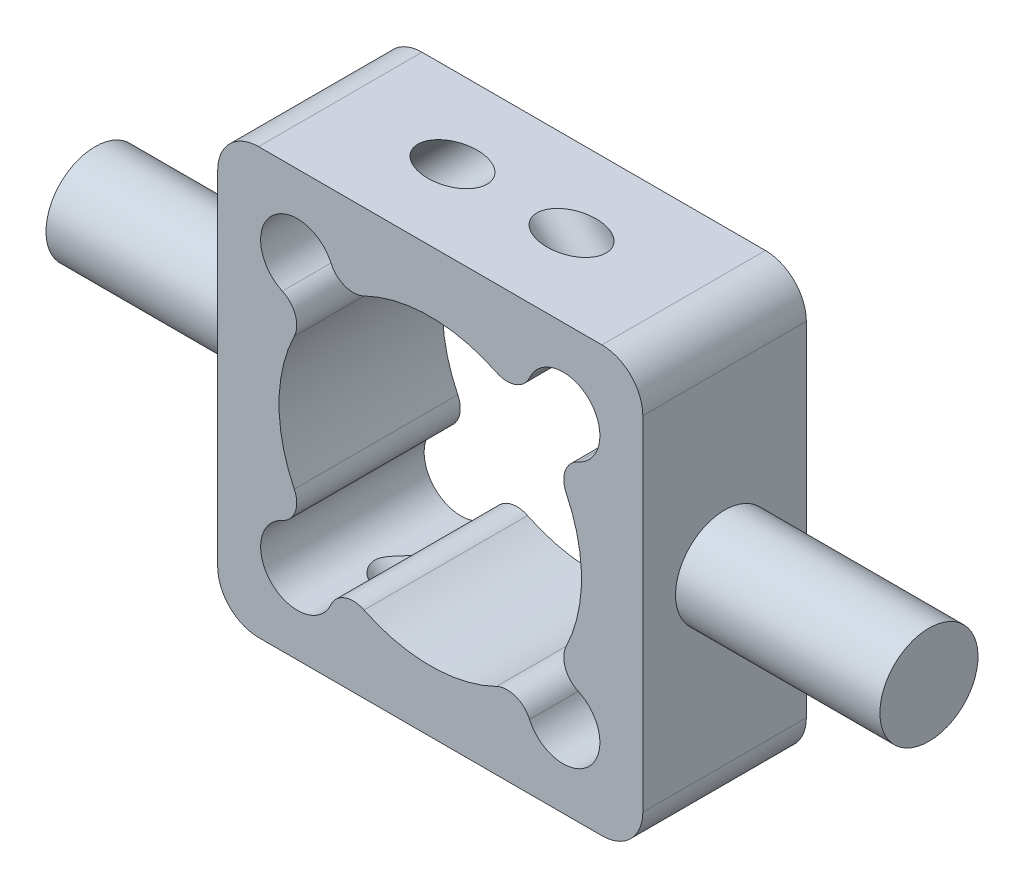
from build123d import *

# Parameters (mm, degrees)
ESBO_O1_W                 = 52
ESBO_O1_H                 = 52
EXTRUS_O1_DEPTH           = 20
ESBO_O2_R                 = 6
EXTRUS_O2_DEPTH           = 25
FILETE2_R                 = 5
ESBO_O6_R                 = 3
EXTRUS_O5_DEPTH           = 25
ESPELHAR3_COPY_1_SKETCH_R = 3
ESPELHAR3_COPY_1_DEPTH    = 25


with BuildPart() as part:
    # Esbo_o1 → Extrus_o1 (new body)
    with BuildSketch(Plane.XY):
        Rectangle(ESBO_O1_W, ESBO_O1_H)
        with BuildLine():
            ThreePointArc((-16.633205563, 8.098547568), (-18.5, 0), (-16.633205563, -8.098547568))
            ThreePointArc((-16.633205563, -8.098547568), (-16.509512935, -10.432674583), (-18.098289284, -12.147095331))
            ThreePointArc((-18.098289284, -12.147095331), (-19.431980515, -19.431980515), (-12.147095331, -18.098289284))
            ThreePointArc((-12.147095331, -18.098289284), (-10.432674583, -16.509512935), (-8.098547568, -16.633205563))
            ThreePointArc((-8.098547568, -16.633205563), (0, -18.5), (8.098547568, -16.633205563))
            ThreePointArc((8.098547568, -16.633205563), (10.432674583, -16.509512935), (12.147095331, -18.098289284))
            ThreePointArc((12.147095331, -18.098289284), (19.431980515, -19.431980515), (18.098289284, -12.147095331))
            ThreePointArc((18.098289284, -12.147095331), (16.509512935, -10.432674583), (16.633205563, -8.098547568))
            ThreePointArc((16.633205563, -8.098547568), (18.5, 0), (16.633205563, 8.098547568))
            ThreePointArc((16.633205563, 8.098547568), (16.509512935, 10.432674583), (18.098289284, 12.147095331))
            ThreePointArc((18.098289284, 12.147095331), (19.431980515, 19.431980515), (12.147095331, 18.098289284))
            ThreePointArc((12.147095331, 18.098289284), (10.432674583, 16.509512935), (8.098547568, 16.633205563))
            ThreePointArc((8.098547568, 16.633205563), (0, 18.5), (-8.098547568, 16.633205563))
            ThreePointArc((-8.098547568, 16.633205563), (-10.432674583, 16.509512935), (-12.147095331, 18.098289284))
            ThreePointArc((-12.147095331, 18.098289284), (-19.431980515, 19.431980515), (-18.098289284, 12.147095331))
            ThreePointArc((-18.098289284, 12.147095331), (-16.509512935, 10.432674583), (-16.633205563, 8.098547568))
        make_face(mode=Mode.SUBTRACT)
    extrude(amount=EXTRUS_O1_DEPTH)

    # Esbo_o2 → Extrus_o2 (add)
    with BuildSketch(Plane.ZY.offset(26)):
        with Locations(Location((10, 0, 0), (0, 0, 90))):
            Circle(ESBO_O2_R)
    extrus_o2 = extrude(amount=EXTRUS_O2_DEPTH)

    # Espelhar1: Extrus_o2 across plane
    add(extrus_o2.mirror(Plane(origin=(0, 0, 0), x_dir=(0, 0, 1), z_dir=(1, 0, 0))))

    # Filete2
    filete2_edges = [part.edges().sort_by_distance(p)[0] for p in [
        (-26, 26, 10),
        (26, 26, 10),
        (26, -26, 10),
        (-26, -26, 10),
    ]]
    fillet(filete2_edges, radius=FILETE2_R)

    # Esbo_o6 → Extrus_o5 (cut)
    with BuildSketch(Plane(origin=(-18.237606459, 18.237606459, 0), x_dir=(0.7071067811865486, 0.7071067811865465, 0), z_dir=(0.7071067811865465, -0.7071067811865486, 0))):
        with Locations(Location((23.535533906, 10, 0), (0, 0, 180))):
            Circle(ESBO_O6_R)
    extrus_o5 = extrude(amount=EXTRUS_O5_DEPTH, mode=Mode.SUBTRACT)

    # Espelhar2: Extrus_o5 across plane
    add(extrus_o5.mirror(Plane(origin=(0, 0, 0), x_dir=(0, 0, 1), z_dir=(1, 0, 0))), mode=Mode.SUBTRACT)

    # Espelhar3: Extrus_o5 across plane
    add(extrus_o5.mirror(Plane.ZX), mode=Mode.SUBTRACT)

    # Espelhar3 copy 1 sketch → Espelhar3 copy 1 (cut)
    with BuildSketch(Plane(origin=(18.237606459, -18.237606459, 0), x_dir=(-0.707106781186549, -0.707106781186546, 0), z_dir=(-0.707106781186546, 0.707106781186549, 0))):
        with Locations(Location((23.535533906, 10, 0), (0, 0, 180))):
            Circle(ESPELHAR3_COPY_1_SKETCH_R)
    extrude(amount=ESPELHAR3_COPY_1_DEPTH, mode=Mode.SUBTRACT)


solid = part.part
